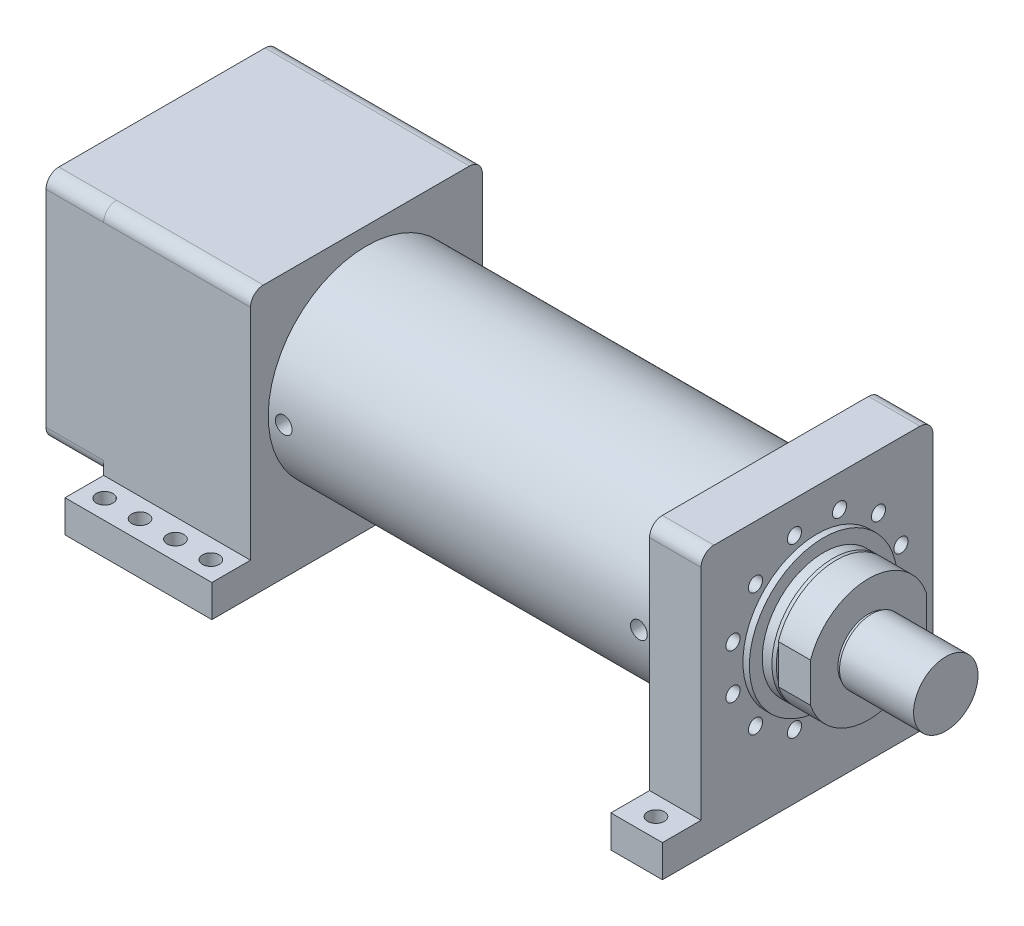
from build123d import *

# Parameters (mm, degrees)
SKETCH_2_W          = 619.5
SKETCH_2_H          = 152.5
SKETCH_3_W          = 360
SKETCH_3_H          = 360
SKETCH_3_R          = 11
EXTRUDE_1_DEPTH     = 80
SKETCH_17_R         = 13
CUT_EXTRUDE_6_DEPTH = 2
SKETCH_23_W         = 360
SKETCH_23_H         = 360
EXTRUDE_8_DEPTH     = 50
SKETCH_28_W         = 360
SKETCH_28_H         = 360
EXTRUDE_12_DEPTH    = 178
SKETCH_29_W         = 360
SKETCH_29_H         = 360
EXTRUDE_13_DEPTH    = 89.5
FILLET_3_R          = 20
SKETCH_19_R         = 13
CUT_EXTRUDE_9_DEPTH = 100
SKETCH_52_R         = 115
EXTRUDE_38_DEPTH    = 10
SKETCH_53_R         = 95
EXTRUDE_39_DEPTH    = 20
CHAMFER_3_SIZE      = 5
CHAMFER_3_SIZE2     = 1.819851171
EXTRUDE_40_DEPTH    = 50
SKETCH_55_R         = 47.5
EXTRUDE_41_DEPTH    = 5
SKETCH_56_R         = 50
EXTRUDE_42_DEPTH    = 115
SKETCH_59_W         = 228
SKETCH_59_H         = 480
SKETCH_59_R         = 13
SKETCH_59_W_2       = 80
EXTRUDE_43_DEPTH    = 50
FILLET_7_R          = 20


with BuildPart() as part:
    # Sketch 2 → Revolve 1 (revolve)
    with BuildSketch(Plane.XY):
        with Locations((309.75, 76.25)):
            Rectangle(SKETCH_2_W, SKETCH_2_H)
    revolve(axis=Axis((619.5, 0, 0), (-1, 0, 0)))

    # Sketch 3 → Extrude 1 (add)
    with BuildSketch(Plane(origin=(619.5, 0, 0), x_dir=(0, 0, -1), z_dir=(1, 0, 0))):
        Rectangle(SKETCH_3_W, SKETCH_3_H)
        with Locations(Location((130.399986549, 34.940571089, 0), (0, 0, 90))):
            Circle(SKETCH_3_R, mode=Mode.SUBTRACT)
        with Locations(Location((130.399986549, -34.940571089, 0), (0, 0, 90))):
            Circle(SKETCH_3_R, mode=Mode.SUBTRACT)
        with Locations(Location((95.45941546, -95.45941546, 0), (0, 0, 90))):
            Circle(SKETCH_3_R, mode=Mode.SUBTRACT)
        with Locations(Location((34.940571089, -130.399986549, 0), (0, 0, 90))):
            Circle(SKETCH_3_R, mode=Mode.SUBTRACT)
        with Locations(Location((-34.940571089, -130.399986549, 0), (0, 0, 90))):
            Circle(SKETCH_3_R, mode=Mode.SUBTRACT)
        with Locations(Location((-95.45941546, -95.45941546, 0), (0, 0, 90))):
            Circle(SKETCH_3_R, mode=Mode.SUBTRACT)
        with Locations(Location((-130.399986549, -34.940571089, 0), (0, 0, 90))):
            Circle(SKETCH_3_R, mode=Mode.SUBTRACT)
        with Locations(Location((-130.399986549, 34.940571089, 0), (0, 0, 90))):
            Circle(SKETCH_3_R, mode=Mode.SUBTRACT)
        with Locations(Location((-95.45941546, 95.45941546, 0), (0, 0, 90))):
            Circle(SKETCH_3_R, mode=Mode.SUBTRACT)
        with Locations(Location((-34.940571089, 130.399986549, 0), (0, 0, 90))):
            Circle(SKETCH_3_R, mode=Mode.SUBTRACT)
        with Locations(Location((34.940571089, 130.399986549, 0), (0, 0, 90))):
            Circle(SKETCH_3_R, mode=Mode.SUBTRACT)
        with Locations(Location((95.45941546, 95.45941546, 0), (0, 0, 90))):
            Circle(SKETCH_3_R, mode=Mode.SUBTRACT)
    extrude(amount=EXTRUDE_1_DEPTH)

    # Sketch 17 → Cut-Extrude 6 (cut)
    with BuildSketch(Plane.XY.offset(-152.5)):
        with Locations(Location((44, 0, 0), (0, 0, 180))):
            Circle(SKETCH_17_R)
    extrude(amount=CUT_EXTRUDE_6_DEPTH, mode=Mode.SUBTRACT)

    # Sketch 23 → Extrude 8 (add)
    with BuildSketch(Plane.ZY):
        Rectangle(SKETCH_23_W, SKETCH_23_H)
    extrude(amount=EXTRUDE_8_DEPTH)

    # Sketch 19 → Cut-Extrude 9 (cut)
    with BuildSketch(Plane.XY.offset(152.5)):
        with Locations((24, 0)):
            Circle(SKETCH_19_R)
        with Locations((575.5, 0)):
            Circle(SKETCH_19_R)
    extrude(amount=-CUT_EXTRUDE_9_DEPTH, mode=Mode.SUBTRACT)



with BuildPart() as body_2:
    # Sketch 28 → Extrude 12 (new body)
    with BuildSketch(Plane.ZY.offset(50)):
        Rectangle(SKETCH_28_W, SKETCH_28_H)
    extrude(amount=EXTRUDE_12_DEPTH)


with BuildPart() as body_3:
    # Sketch 29 → Extrude 13 (new body)
    with BuildSketch(Plane.ZY.offset(228)):
        Rectangle(SKETCH_29_W, SKETCH_29_H)
    extrude(amount=EXTRUDE_13_DEPTH)

    # Fillet 3
    fillet_3_edges = [body_3.edges().sort_by_distance(p)[0] for p in [
        (-272.75, -180, 180),
        (-272.75, -180, -180),
        (-272.75, 180, -180),
        (-272.75, 180, 180),
    ]]
    fillet(fillet_3_edges, radius=FILLET_3_R)


with BuildPart() as body_4:
    # Sketch 52 → Extrude 38 (new body)
    with BuildSketch(Plane(origin=(699.5, 0, 0), x_dir=(0, 0, -1), z_dir=(1, 0, 0))):
        Circle(SKETCH_52_R)
    extrude(amount=EXTRUDE_38_DEPTH)


with BuildPart() as body_5:
    # Sketch 53 → Extrude 39 (new body)
    with BuildSketch(Plane(origin=(709.5, 0, 0), x_dir=(0, 0, -1), z_dir=(1, 0, 0))):
        Circle(SKETCH_53_R)
    extrude(amount=EXTRUDE_39_DEPTH)

    # Chamfer 3
    chamfer_3_edges = [body_5.edges().sort_by_distance(p)[0] for p in [
        (729.5, 0, 95),
    ]]
    chamfer_3_side = [body_5.faces().sort_by_distance(p)[0] for p in [
        (719.5, 0, 95),
    ]]
    chamfer(chamfer_3_edges, length=CHAMFER_3_SIZE, length2=CHAMFER_3_SIZE2, reference=chamfer_3_side[0])


with BuildPart() as body_6:
    # Sketch 54 → Extrude 40 (new body)
    with BuildSketch(Plane(origin=(729.5, 0, 0), x_dir=(0, 0, -1), z_dir=(1, 0, 0))):
        with BuildLine():
            Line((-90, 30.413812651), (-90, -30.413812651))
            ThreePointArc((-90, -30.413812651), (0, -95), (90, -30.413812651))
            Line((90, -30.413812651), (90, 30.413812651))
            ThreePointArc((90, 30.413812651), (0, 95), (-90, 30.413812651))
        make_face()
    extrude(amount=EXTRUDE_40_DEPTH)

    # Sketch 55 → Extrude 41 (add)
    with BuildSketch(Plane(origin=(779.5, 0, 0), x_dir=(0, 0, -1), z_dir=(1, 0, 0))):
        Circle(SKETCH_55_R)
    extrude(amount=EXTRUDE_41_DEPTH)

    # Sketch 56 → Extrude 42 (add)
    with BuildSketch(Plane(origin=(784.5, 0, 0), x_dir=(0, 0, -1), z_dir=(1, 0, 0))):
        Circle(SKETCH_56_R)
    extrude(amount=EXTRUDE_42_DEPTH)


with BuildPart() as part_1:
    add(part.part)

    add(body_2.part)  # Extrude 43 merges body 2

    add(body_3.part)  # Extrude 43 merges body 3
    # Sketch 59 → Extrude 43 (add)
    # profile 1 of 2: a face of its own
    with BuildSketch(Plane.XZ.offset(180)):
        with Locations((-114, 0)):
            Rectangle(SKETCH_59_W, SKETCH_59_H)
        with Locations((-196.5, 210)):
            Circle(SKETCH_59_R, mode=Mode.SUBTRACT)
        with Locations((-141.5, 210)):
            Circle(SKETCH_59_R, mode=Mode.SUBTRACT)
        with Locations((-86.5, 210)):
            Circle(SKETCH_59_R, mode=Mode.SUBTRACT)
        with Locations((-31.5, 210)):
            Circle(SKETCH_59_R, mode=Mode.SUBTRACT)
        with Locations(Location((-31.5, -210, 0), (0, 0, 180))):
            Circle(SKETCH_59_R, mode=Mode.SUBTRACT)
        with Locations(Location((-86.5, -210, 0), (0, 0, 180))):
            Circle(SKETCH_59_R, mode=Mode.SUBTRACT)
        with Locations(Location((-141.5, -210, 0), (0, 0, 180))):
            Circle(SKETCH_59_R, mode=Mode.SUBTRACT)
        with Locations(Location((-196.5, -210, 0), (0, 0, 180))):
            Circle(SKETCH_59_R, mode=Mode.SUBTRACT)
    # profile 2 of 2: a face of its own
    with BuildSketch(Plane.XZ.offset(180)):
        with Locations((659.5, 0)):
            Rectangle(SKETCH_59_W_2, SKETCH_59_H)
        with Locations((659.5, 210)):
            Circle(SKETCH_59_R, mode=Mode.SUBTRACT)
        with Locations(Location((659.5, -210, 0), (0, 0, 180))):
            Circle(SKETCH_59_R, mode=Mode.SUBTRACT)
    extrude(amount=EXTRUDE_43_DEPTH)

    # Fillet 7
    fillet_7_edges = [part_1.edges().sort_by_distance(p)[0] for p in [
        (659.5, 180, -180),
        (659.5, 180, 180),
        (-114, 180, -180),
        (-114, 180, 180),
    ]]
    fillet(fillet_7_edges, radius=FILLET_7_R)


solid = Compound([body_4.part, body_5.part, body_6.part, part_1.part])
